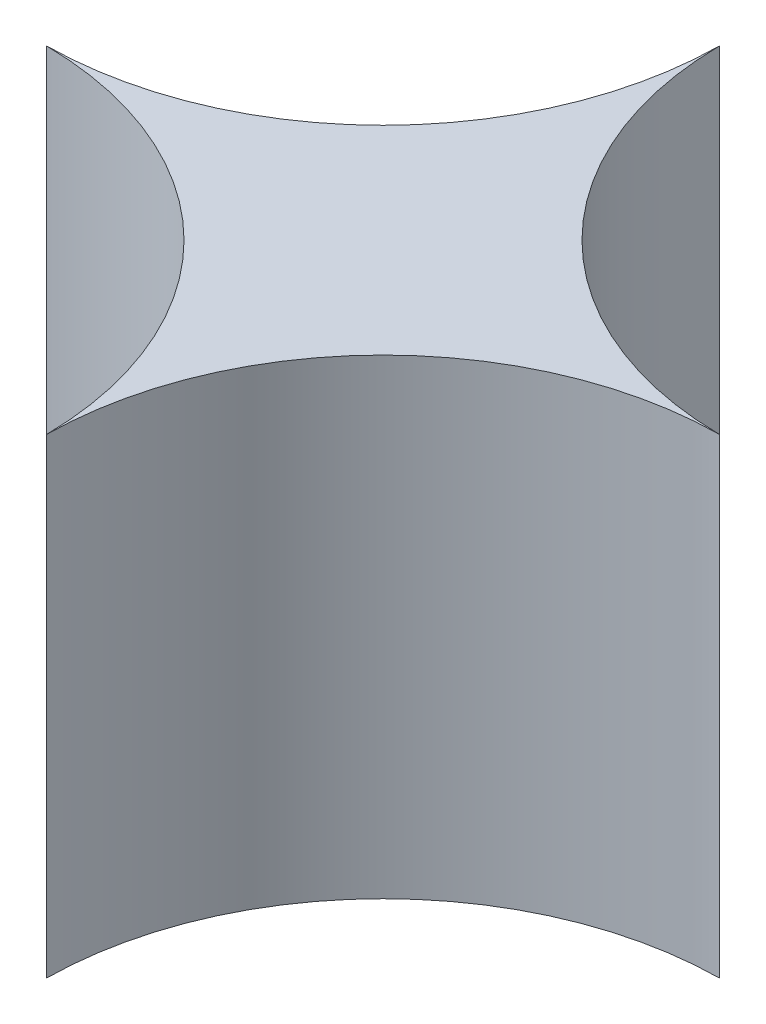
from build123d import *

# Parameters (mm, degrees)
BOSS_EXTRUDE1_DEPTH = 35
SCALE1_SCALE        = 0.9


with BuildPart() as part:
    # Sketch1 → Boss-Extrude1 (new body)
    with BuildSketch(Plane(origin=(0, 0, 0), x_dir=(1, 0, 0), z_dir=(0, 1, 0))):
        with BuildLine():
            ThreePointArc((-25, -0.001237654), (-7.395553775, -7.395553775), (-0.001237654, -25))
            Line((-0.001237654, -25), (0.001237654, -25))
            ThreePointArc((0.001237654, -25), (7.395553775, -7.395553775), (25, -0.001237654))
            Line((25, -0.001237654), (25, 0.001237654))
            ThreePointArc((25, 0.001237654), (7.395553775, 7.395553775), (0.001237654, 25))
            Line((0.001237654, 25), (-0.001237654, 25))
            ThreePointArc((-0.001237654, 25), (-7.395553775, 7.395553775), (-25, 0.001237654))
            Line((-25, 0.001237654), (-25, -0.001237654))
        make_face()
    extrude(amount=BOSS_EXTRUDE1_DEPTH)


with BuildPart() as part_1:
    # Scale1: scaled about (0, 17.5, 0)
    add(part.part.scale(SCALE1_SCALE).moved(Location((0, 1.75, 0))))


solid = part_1.part
